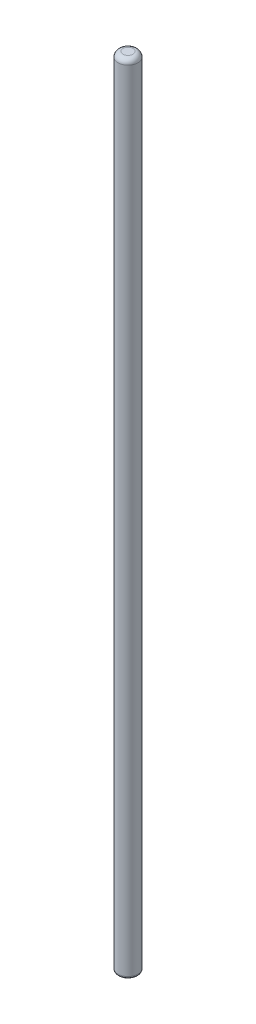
ISO-10303-21;
HEADER;
FILE_DESCRIPTION(('STEP AP214'),'2;1');
FILE_NAME('part.step','',(''),(''),'','','');
FILE_SCHEMA(('AUTOMOTIVE_DESIGN { 1 0 10303 214 1 1 1 1 }'));
ENDSEC;
DATA;
#1=APPLICATION_CONTEXT('core data for automotive mechanical design processes');
#2=APPLICATION_PROTOCOL_DEFINITION('international standard','automotive_design',2000,#1);
#3=PRODUCT_CONTEXT('',#1,'mechanical');
#4=PRODUCT('Part','Part','',(#3));
#5=PRODUCT_RELATED_PRODUCT_CATEGORY('part','',(#4));
#6=PRODUCT_DEFINITION_FORMATION('','',#4);
#7=PRODUCT_DEFINITION_CONTEXT('part definition',#1,'design');
#8=PRODUCT_DEFINITION('design','',#6,#7);
#9=PRODUCT_DEFINITION_SHAPE('','',#8);
#10=(LENGTH_UNIT() NAMED_UNIT(*) SI_UNIT(.MILLI.,.METRE.));
#11=(NAMED_UNIT(*) PLANE_ANGLE_UNIT() SI_UNIT($,.RADIAN.));
#12=(NAMED_UNIT(*) SI_UNIT($,.STERADIAN.) SOLID_ANGLE_UNIT());
#13=UNCERTAINTY_MEASURE_WITH_UNIT(LENGTH_MEASURE(1.E-05),#10,'distance_accuracy_value','');
#14=(GEOMETRIC_REPRESENTATION_CONTEXT(3) GLOBAL_UNCERTAINTY_ASSIGNED_CONTEXT((#13)) GLOBAL_UNIT_ASSIGNED_CONTEXT((#10,
#11,#12)) REPRESENTATION_CONTEXT('',''));
#15=CARTESIAN_POINT('',(0.,0.,0.));
#16=DIRECTION('',(0.,0.,1.));
#17=DIRECTION('',(1.,0.,0.));
#18=AXIS2_PLACEMENT_3D('',#15,#16,#17);
#19=CARTESIAN_POINT('',(0.,508.,0.));
#20=DIRECTION('',(0.,-1.,0.));
#21=DIRECTION('',(0.,0.,-1.));
#22=AXIS2_PLACEMENT_3D('',#19,#20,#21);
#23=CYLINDRICAL_SURFACE('',#22,6.35);
#24=CARTESIAN_POINT('',(0.,1.58749999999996,0.));
#25=DIRECTION('',(0.,1.,0.));
#26=DIRECTION('',(0.,0.,1.));
#27=AXIS2_PLACEMENT_3D('',#24,#25,#26);
#28=CIRCLE('',#27,6.35);
#29=CARTESIAN_POINT('',(0.,1.58749999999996,6.35));
#30=VERTEX_POINT('',#29);
#31=EDGE_CURVE('E44',#30,#30,#28,.T.);
#32=ORIENTED_EDGE('',*,*,#31,.T.);
#33=EDGE_LOOP('',(#32));
#34=FACE_BOUND('',#33,.T.);
#35=CARTESIAN_POINT('',(0.,504.825,0.));
#36=DIRECTION('',(0.,1.,0.));
#37=DIRECTION('',(0.,0.,1.));
#38=AXIS2_PLACEMENT_3D('',#35,#36,#37);
#39=CIRCLE('',#38,6.35);
#40=CARTESIAN_POINT('',(0.,504.825,6.35));
#41=VERTEX_POINT('',#40);
#42=EDGE_CURVE('E48',#41,#41,#39,.F.);
#43=ORIENTED_EDGE('',*,*,#42,.T.);
#44=EDGE_LOOP('',(#43));
#45=FACE_BOUND('',#44,.T.);
#46=ADVANCED_FACE('F33',(#34,#45),#23,.T.);
#47=CARTESIAN_POINT('',(0.,508.,0.));
#48=DIRECTION('',(0.,1.,0.));
#49=DIRECTION('',(0.,0.,1.));
#50=AXIS2_PLACEMENT_3D('',#47,#48,#49);
#51=PLANE('',#50);
#52=CARTESIAN_POINT('',(0.,508.,0.));
#53=DIRECTION('',(0.,1.,0.));
#54=DIRECTION('',(0.,0.,1.));
#55=AXIS2_PLACEMENT_3D('',#52,#53,#54);
#56=CIRCLE('',#55,3.175);
#57=CARTESIAN_POINT('',(0.,508.,3.175));
#58=VERTEX_POINT('',#57);
#59=EDGE_CURVE('E11',#58,#58,#56,.T.);
#60=ORIENTED_EDGE('',*,*,#59,.T.);
#61=EDGE_LOOP('',(#60));
#62=FACE_BOUND('',#61,.T.);
#63=ADVANCED_FACE('F64',(#62),#51,.T.);
#64=CARTESIAN_POINT('',(0.,0.,0.));
#65=DIRECTION('',(0.,1.,0.));
#66=DIRECTION('',(0.,0.,1.));
#67=AXIS2_PLACEMENT_3D('',#64,#65,#66);
#68=PLANE('',#67);
#69=CARTESIAN_POINT('',(0.,0.,0.));
#70=DIRECTION('',(0.,1.,0.));
#71=DIRECTION('',(0.,0.,1.));
#72=AXIS2_PLACEMENT_3D('',#69,#70,#71);
#73=CIRCLE('',#72,4.7625);
#74=CARTESIAN_POINT('',(0.,0.,4.7625));
#75=VERTEX_POINT('',#74);
#76=EDGE_CURVE('E40',#75,#75,#73,.F.);
#77=ORIENTED_EDGE('',*,*,#76,.T.);
#78=EDGE_LOOP('',(#77));
#79=FACE_BOUND('',#78,.T.);
#80=ADVANCED_FACE('F61',(#79),#68,.F.);
#81=CARTESIAN_POINT('',(0.,1.58749999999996,0.));
#82=DIRECTION('',(0.,1.,0.));
#83=DIRECTION('',(0.,0.,1.));
#84=AXIS2_PLACEMENT_3D('',#81,#82,#83);
#85=TOROIDAL_SURFACE('',#84,4.7625,1.5875);
#86=ORIENTED_EDGE('',*,*,#76,.F.);
#87=EDGE_LOOP('',(#86));
#88=FACE_BOUND('',#87,.T.);
#89=ORIENTED_EDGE('',*,*,#31,.F.);
#90=EDGE_LOOP('',(#89));
#91=FACE_BOUND('',#90,.T.);
#92=ADVANCED_FACE('F57',(#88,#91),#85,.T.);
#93=CARTESIAN_POINT('',(0.,504.825,0.));
#94=DIRECTION('',(0.,1.,0.));
#95=DIRECTION('',(0.,0.,1.));
#96=AXIS2_PLACEMENT_3D('',#93,#94,#95);
#97=DEGENERATE_TOROIDAL_SURFACE('',#96,3.175,3.175,.T.);
#98=ORIENTED_EDGE('',*,*,#42,.F.);
#99=EDGE_LOOP('',(#98));
#100=FACE_BOUND('',#99,.T.);
#101=ORIENTED_EDGE('',*,*,#59,.F.);
#102=EDGE_LOOP('',(#101));
#103=FACE_BOUND('',#102,.T.);
#104=ADVANCED_FACE('F35',(#100,#103),#97,.T.);
#105=CLOSED_SHELL('',(#46,#63,#80,#92,#104));
#106=MANIFOLD_SOLID_BREP('B2',#105);
#107=ADVANCED_BREP_SHAPE_REPRESENTATION('',(#18,#106),#14);
#108=SHAPE_DEFINITION_REPRESENTATION(#9,#107);
ENDSEC;
END-ISO-10303-21;
